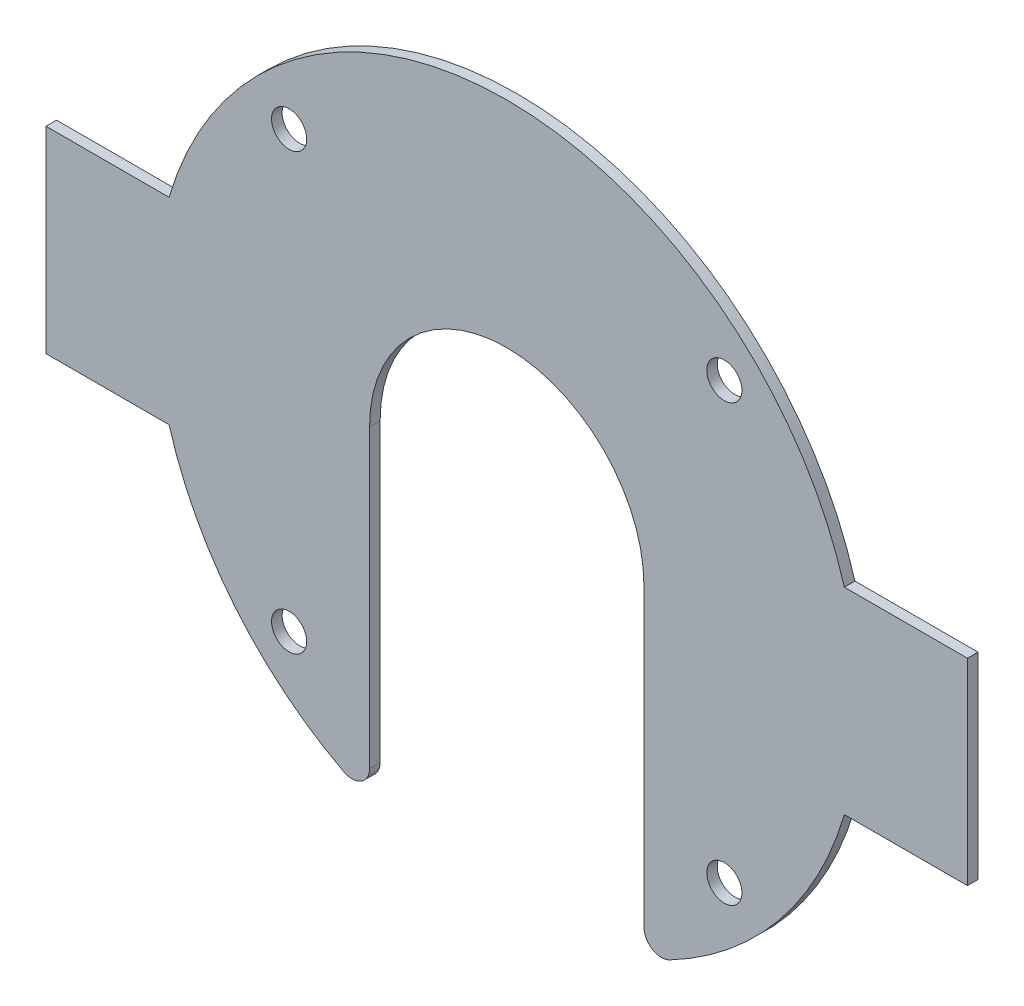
ISO-10303-21;
HEADER;
FILE_DESCRIPTION(('STEP AP214'),'2;1');
FILE_NAME('part.step','',(''),(''),'','','');
FILE_SCHEMA(('AUTOMOTIVE_DESIGN { 1 0 10303 214 1 1 1 1 }'));
ENDSEC;
DATA;
#1=APPLICATION_CONTEXT('core data for automotive mechanical design processes');
#2=APPLICATION_PROTOCOL_DEFINITION('international standard','automotive_design',2000,#1);
#3=PRODUCT_CONTEXT('',#1,'mechanical');
#4=PRODUCT('Part','Part','',(#3));
#5=PRODUCT_RELATED_PRODUCT_CATEGORY('part','',(#4));
#6=PRODUCT_DEFINITION_FORMATION('','',#4);
#7=PRODUCT_DEFINITION_CONTEXT('part definition',#1,'design');
#8=PRODUCT_DEFINITION('design','',#6,#7);
#9=PRODUCT_DEFINITION_SHAPE('','',#8);
#10=(LENGTH_UNIT() NAMED_UNIT(*) SI_UNIT(.MILLI.,.METRE.));
#11=(NAMED_UNIT(*) PLANE_ANGLE_UNIT() SI_UNIT($,.RADIAN.));
#12=(NAMED_UNIT(*) SI_UNIT($,.STERADIAN.) SOLID_ANGLE_UNIT());
#13=UNCERTAINTY_MEASURE_WITH_UNIT(LENGTH_MEASURE(1.E-05),#10,'distance_accuracy_value','');
#14=(GEOMETRIC_REPRESENTATION_CONTEXT(3) GLOBAL_UNCERTAINTY_ASSIGNED_CONTEXT((#13)) GLOBAL_UNIT_ASSIGNED_CONTEXT((#10,
#11,#12)) REPRESENTATION_CONTEXT('',''));
#15=CARTESIAN_POINT('',(0.,0.,0.));
#16=DIRECTION('',(0.,0.,1.));
#17=DIRECTION('',(1.,0.,0.));
#18=AXIS2_PLACEMENT_3D('',#15,#16,#17);
#19=CARTESIAN_POINT('',(0.,0.,3.));
#20=DIRECTION('',(0.,0.,1.));
#21=DIRECTION('',(1.,0.,0.));
#22=AXIS2_PLACEMENT_3D('',#19,#20,#21);
#23=PLANE('',#22);
#24=CARTESIAN_POINT('',(-61.8718433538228,-61.871843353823,3.));
#25=DIRECTION('',(0.,0.,1.));
#26=DIRECTION('',(1.,0.,0.));
#27=AXIS2_PLACEMENT_3D('',#24,#25,#26);
#28=CIRCLE('',#27,5.);
#29=CARTESIAN_POINT('',(-56.8718433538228,-61.871843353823,3.));
#30=VERTEX_POINT('',#29);
#31=EDGE_CURVE('E320',#30,#30,#28,.T.);
#32=ORIENTED_EDGE('',*,*,#31,.F.);
#33=EDGE_LOOP('',(#32));
#34=FACE_BOUND('',#33,.T.);
#35=CARTESIAN_POINT('',(61.8718433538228,61.871843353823,3.));
#36=DIRECTION('',(0.,0.,1.));
#37=DIRECTION('',(1.,0.,0.));
#38=AXIS2_PLACEMENT_3D('',#35,#36,#37);
#39=CIRCLE('',#38,5.);
#40=CARTESIAN_POINT('',(66.8718433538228,61.871843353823,3.));
#41=VERTEX_POINT('',#40);
#42=EDGE_CURVE('E172',#41,#41,#39,.T.);
#43=ORIENTED_EDGE('',*,*,#42,.F.);
#44=EDGE_LOOP('',(#43));
#45=FACE_BOUND('',#44,.T.);
#46=CARTESIAN_POINT('',(0.,0.,3.));
#47=DIRECTION('',(0.,0.,-1.));
#48=DIRECTION('',(1.,0.,0.));
#49=AXIS2_PLACEMENT_3D('',#46,#47,#48);
#50=CIRCLE('',#49,39.);
#51=CARTESIAN_POINT('',(-39.,0.,3.));
#52=VERTEX_POINT('',#51);
#53=CARTESIAN_POINT('',(39.,0.,3.));
#54=VERTEX_POINT('',#53);
#55=EDGE_CURVE('E195',#52,#54,#50,.T.);
#56=ORIENTED_EDGE('',*,*,#55,.T.);
#57=DIRECTION('',(0.,-1.,0.));
#58=VECTOR('',#57,1.);
#59=CARTESIAN_POINT('',(39.,0.,3.));
#60=LINE('',#59,#58);
#61=CARTESIAN_POINT('',(39.,-84.1961994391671,3.));
#62=VERTEX_POINT('',#61);
#63=EDGE_CURVE('E113',#54,#62,#60,.T.);
#64=ORIENTED_EDGE('',*,*,#63,.T.);
#65=CARTESIAN_POINT('',(44.,-84.1961994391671,3.));
#66=DIRECTION('',(0.,0.,1.));
#67=DIRECTION('',(-1.,0.,0.));
#68=AXIS2_PLACEMENT_3D('',#65,#66,#67);
#69=CIRCLE('',#68,5.);
#70=CARTESIAN_POINT('',(46.3157894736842,-88.627578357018,3.));
#71=VERTEX_POINT('',#70);
#72=EDGE_CURVE('E228',#62,#71,#69,.T.);
#73=ORIENTED_EDGE('',*,*,#72,.T.);
#74=CARTESIAN_POINT('',(0.,0.,3.));
#75=DIRECTION('',(0.,0.,1.));
#76=DIRECTION('',(1.,0.,0.));
#77=AXIS2_PLACEMENT_3D('',#74,#75,#76);
#78=CIRCLE('',#77,100.);
#79=CARTESIAN_POINT('',(96.,-28.,3.));
#80=VERTEX_POINT('',#79);
#81=EDGE_CURVE('E247',#71,#80,#78,.T.);
#82=ORIENTED_EDGE('',*,*,#81,.T.);
#83=DIRECTION('',(1.,0.,0.));
#84=VECTOR('',#83,1.);
#85=CARTESIAN_POINT('',(131.,-28.,3.));
#86=LINE('',#85,#84);
#87=CARTESIAN_POINT('',(131.,-28.,3.));
#88=VERTEX_POINT('',#87);
#89=EDGE_CURVE('E244',#80,#88,#86,.T.);
#90=ORIENTED_EDGE('',*,*,#89,.T.);
#91=DIRECTION('',(0.,1.,0.));
#92=VECTOR('',#91,1.);
#93=CARTESIAN_POINT('',(131.,28.,3.));
#94=LINE('',#93,#92);
#95=CARTESIAN_POINT('',(131.,28.,3.));
#96=VERTEX_POINT('',#95);
#97=EDGE_CURVE('E246',#88,#96,#94,.T.);
#98=ORIENTED_EDGE('',*,*,#97,.T.);
#99=DIRECTION('',(-1.,0.,0.));
#100=VECTOR('',#99,1.);
#101=CARTESIAN_POINT('',(96.,28.,3.));
#102=LINE('',#101,#100);
#103=CARTESIAN_POINT('',(96.,28.,3.));
#104=VERTEX_POINT('',#103);
#105=EDGE_CURVE('E249',#96,#104,#102,.T.);
#106=ORIENTED_EDGE('',*,*,#105,.T.);
#107=CARTESIAN_POINT('',(0.,0.,3.));
#108=DIRECTION('',(0.,0.,1.));
#109=DIRECTION('',(1.,0.,0.));
#110=AXIS2_PLACEMENT_3D('',#107,#108,#109);
#111=CIRCLE('',#110,100.);
#112=CARTESIAN_POINT('',(-96.,28.,3.));
#113=VERTEX_POINT('',#112);
#114=EDGE_CURVE('E255',#104,#113,#111,.T.);
#115=ORIENTED_EDGE('',*,*,#114,.T.);
#116=DIRECTION('',(-1.,0.,0.));
#117=VECTOR('',#116,1.);
#118=CARTESIAN_POINT('',(-96.,28.,3.));
#119=LINE('',#118,#117);
#120=CARTESIAN_POINT('',(-131.,28.,3.));
#121=VERTEX_POINT('',#120);
#122=EDGE_CURVE('E257',#113,#121,#119,.T.);
#123=ORIENTED_EDGE('',*,*,#122,.T.);
#124=DIRECTION('',(0.,-1.,0.));
#125=VECTOR('',#124,1.);
#126=CARTESIAN_POINT('',(-131.,28.,3.));
#127=LINE('',#126,#125);
#128=CARTESIAN_POINT('',(-131.,-28.,3.));
#129=VERTEX_POINT('',#128);
#130=EDGE_CURVE('E259',#121,#129,#127,.T.);
#131=ORIENTED_EDGE('',*,*,#130,.T.);
#132=DIRECTION('',(1.,0.,0.));
#133=VECTOR('',#132,1.);
#134=CARTESIAN_POINT('',(-131.,-28.,3.));
#135=LINE('',#134,#133);
#136=CARTESIAN_POINT('',(-96.,-28.,3.));
#137=VERTEX_POINT('',#136);
#138=EDGE_CURVE('E150',#129,#137,#135,.T.);
#139=ORIENTED_EDGE('',*,*,#138,.T.);
#140=CARTESIAN_POINT('',(0.,0.,3.));
#141=DIRECTION('',(0.,0.,1.));
#142=DIRECTION('',(1.,0.,0.));
#143=AXIS2_PLACEMENT_3D('',#140,#141,#142);
#144=CIRCLE('',#143,100.);
#145=CARTESIAN_POINT('',(-46.3157894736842,-88.627578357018,3.));
#146=VERTEX_POINT('',#145);
#147=EDGE_CURVE('E144',#137,#146,#144,.T.);
#148=ORIENTED_EDGE('',*,*,#147,.T.);
#149=CARTESIAN_POINT('',(-44.,-84.1961994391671,3.));
#150=DIRECTION('',(0.,0.,1.));
#151=DIRECTION('',(-1.,0.,0.));
#152=AXIS2_PLACEMENT_3D('',#149,#150,#151);
#153=CIRCLE('',#152,5.);
#154=CARTESIAN_POINT('',(-39.,-84.1961994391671,3.));
#155=VERTEX_POINT('',#154);
#156=EDGE_CURVE('E148',#146,#155,#153,.T.);
#157=ORIENTED_EDGE('',*,*,#156,.T.);
#158=DIRECTION('',(0.,1.,0.));
#159=VECTOR('',#158,1.);
#160=CARTESIAN_POINT('',(-39.,0.,3.));
#161=LINE('',#160,#159);
#162=EDGE_CURVE('E52',#155,#52,#161,.T.);
#163=ORIENTED_EDGE('',*,*,#162,.T.);
#164=EDGE_LOOP('',(#56,#64,#73,#82,#90,#98,#106,#115,#123,#131,#139,#148,#157,#163));
#165=FACE_BOUND('',#164,.T.);
#166=CARTESIAN_POINT('',(-61.8718433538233,61.8718433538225,3.));
#167=DIRECTION('',(0.,0.,1.));
#168=DIRECTION('',(1.,0.,0.));
#169=AXIS2_PLACEMENT_3D('',#166,#167,#168);
#170=CIRCLE('',#169,5.);
#171=CARTESIAN_POINT('',(-56.8718433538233,61.8718433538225,3.));
#172=VERTEX_POINT('',#171);
#173=EDGE_CURVE('E326',#172,#172,#170,.T.);
#174=ORIENTED_EDGE('',*,*,#173,.F.);
#175=EDGE_LOOP('',(#174));
#176=FACE_BOUND('',#175,.T.);
#177=CARTESIAN_POINT('',(61.8718433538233,-61.8718433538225,3.));
#178=DIRECTION('',(0.,0.,1.));
#179=DIRECTION('',(1.,0.,0.));
#180=AXIS2_PLACEMENT_3D('',#177,#178,#179);
#181=CIRCLE('',#180,5.);
#182=CARTESIAN_POINT('',(66.8718433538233,-61.8718433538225,3.));
#183=VERTEX_POINT('',#182);
#184=EDGE_CURVE('E311',#183,#183,#181,.T.);
#185=ORIENTED_EDGE('',*,*,#184,.F.);
#186=EDGE_LOOP('',(#185));
#187=FACE_BOUND('',#186,.T.);
#188=ADVANCED_FACE('F35',(#34,#45,#165,#176,#187),#23,.T.);
#189=CARTESIAN_POINT('',(0.,0.,0.));
#190=DIRECTION('',(0.,0.,1.));
#191=DIRECTION('',(1.,0.,0.));
#192=AXIS2_PLACEMENT_3D('',#189,#190,#191);
#193=PLANE('',#192);
#194=CARTESIAN_POINT('',(-61.8718433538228,-61.871843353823,0.));
#195=DIRECTION('',(0.,0.,1.));
#196=DIRECTION('',(1.,0.,0.));
#197=AXIS2_PLACEMENT_3D('',#194,#195,#196);
#198=CIRCLE('',#197,5.);
#199=CARTESIAN_POINT('',(-56.8718433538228,-61.871843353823,0.));
#200=VERTEX_POINT('',#199);
#201=EDGE_CURVE('E317',#200,#200,#198,.T.);
#202=ORIENTED_EDGE('',*,*,#201,.T.);
#203=EDGE_LOOP('',(#202));
#204=FACE_BOUND('',#203,.T.);
#205=CARTESIAN_POINT('',(61.8718433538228,61.871843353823,0.));
#206=DIRECTION('',(0.,0.,1.));
#207=DIRECTION('',(1.,0.,0.));
#208=AXIS2_PLACEMENT_3D('',#205,#206,#207);
#209=CIRCLE('',#208,5.);
#210=CARTESIAN_POINT('',(66.8718433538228,61.871843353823,0.));
#211=VERTEX_POINT('',#210);
#212=EDGE_CURVE('E329',#211,#211,#209,.T.);
#213=ORIENTED_EDGE('',*,*,#212,.T.);
#214=EDGE_LOOP('',(#213));
#215=FACE_BOUND('',#214,.T.);
#216=CARTESIAN_POINT('',(0.,0.,0.));
#217=DIRECTION('',(0.,0.,-1.));
#218=DIRECTION('',(1.,0.,0.));
#219=AXIS2_PLACEMENT_3D('',#216,#217,#218);
#220=CIRCLE('',#219,39.);
#221=CARTESIAN_POINT('',(-39.,0.,0.));
#222=VERTEX_POINT('',#221);
#223=CARTESIAN_POINT('',(39.,0.,0.));
#224=VERTEX_POINT('',#223);
#225=EDGE_CURVE('E168',#222,#224,#220,.T.);
#226=ORIENTED_EDGE('',*,*,#225,.F.);
#227=DIRECTION('',(0.,1.,0.));
#228=VECTOR('',#227,1.);
#229=CARTESIAN_POINT('',(-39.,0.,0.));
#230=LINE('',#229,#228);
#231=CARTESIAN_POINT('',(-39.,-84.1961994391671,0.));
#232=VERTEX_POINT('',#231);
#233=EDGE_CURVE('E105',#232,#222,#230,.T.);
#234=ORIENTED_EDGE('',*,*,#233,.F.);
#235=CARTESIAN_POINT('',(-44.,-84.1961994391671,0.));
#236=DIRECTION('',(0.,0.,1.));
#237=DIRECTION('',(-1.,0.,0.));
#238=AXIS2_PLACEMENT_3D('',#235,#236,#237);
#239=CIRCLE('',#238,5.);
#240=CARTESIAN_POINT('',(-46.3157894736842,-88.627578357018,0.));
#241=VERTEX_POINT('',#240);
#242=EDGE_CURVE('E99',#241,#232,#239,.T.);
#243=ORIENTED_EDGE('',*,*,#242,.F.);
#244=CARTESIAN_POINT('',(0.,0.,0.));
#245=DIRECTION('',(0.,0.,1.));
#246=DIRECTION('',(1.,0.,0.));
#247=AXIS2_PLACEMENT_3D('',#244,#245,#246);
#248=CIRCLE('',#247,100.);
#249=CARTESIAN_POINT('',(-96.,-28.,0.));
#250=VERTEX_POINT('',#249);
#251=EDGE_CURVE('E158',#250,#241,#248,.T.);
#252=ORIENTED_EDGE('',*,*,#251,.F.);
#253=DIRECTION('',(1.,0.,0.));
#254=VECTOR('',#253,1.);
#255=CARTESIAN_POINT('',(-131.,-28.,0.));
#256=LINE('',#255,#254);
#257=CARTESIAN_POINT('',(-131.,-28.,0.));
#258=VERTEX_POINT('',#257);
#259=EDGE_CURVE('E190',#258,#250,#256,.T.);
#260=ORIENTED_EDGE('',*,*,#259,.F.);
#261=DIRECTION('',(0.,-1.,0.));
#262=VECTOR('',#261,1.);
#263=CARTESIAN_POINT('',(-131.,28.,0.));
#264=LINE('',#263,#262);
#265=CARTESIAN_POINT('',(-131.,28.,0.));
#266=VERTEX_POINT('',#265);
#267=EDGE_CURVE('E188',#266,#258,#264,.T.);
#268=ORIENTED_EDGE('',*,*,#267,.F.);
#269=DIRECTION('',(-1.,0.,0.));
#270=VECTOR('',#269,1.);
#271=CARTESIAN_POINT('',(-96.,28.,0.));
#272=LINE('',#271,#270);
#273=CARTESIAN_POINT('',(-96.,28.,0.));
#274=VERTEX_POINT('',#273);
#275=EDGE_CURVE('E186',#274,#266,#272,.T.);
#276=ORIENTED_EDGE('',*,*,#275,.F.);
#277=CARTESIAN_POINT('',(0.,0.,0.));
#278=DIRECTION('',(0.,0.,1.));
#279=DIRECTION('',(1.,0.,0.));
#280=AXIS2_PLACEMENT_3D('',#277,#278,#279);
#281=CIRCLE('',#280,100.);
#282=CARTESIAN_POINT('',(96.,28.,0.));
#283=VERTEX_POINT('',#282);
#284=EDGE_CURVE('E184',#283,#274,#281,.T.);
#285=ORIENTED_EDGE('',*,*,#284,.F.);
#286=DIRECTION('',(-1.,0.,0.));
#287=VECTOR('',#286,1.);
#288=CARTESIAN_POINT('',(96.,28.,0.));
#289=LINE('',#288,#287);
#290=CARTESIAN_POINT('',(131.,28.,0.));
#291=VERTEX_POINT('',#290);
#292=EDGE_CURVE('E182',#291,#283,#289,.T.);
#293=ORIENTED_EDGE('',*,*,#292,.F.);
#294=DIRECTION('',(0.,1.,0.));
#295=VECTOR('',#294,1.);
#296=CARTESIAN_POINT('',(131.,28.,0.));
#297=LINE('',#296,#295);
#298=CARTESIAN_POINT('',(131.,-28.,0.));
#299=VERTEX_POINT('',#298);
#300=EDGE_CURVE('E180',#299,#291,#297,.T.);
#301=ORIENTED_EDGE('',*,*,#300,.F.);
#302=DIRECTION('',(1.,0.,0.));
#303=VECTOR('',#302,1.);
#304=CARTESIAN_POINT('',(131.,-28.,0.));
#305=LINE('',#304,#303);
#306=CARTESIAN_POINT('',(96.,-28.,0.));
#307=VERTEX_POINT('',#306);
#308=EDGE_CURVE('E178',#307,#299,#305,.T.);
#309=ORIENTED_EDGE('',*,*,#308,.F.);
#310=CARTESIAN_POINT('',(0.,0.,0.));
#311=DIRECTION('',(0.,0.,1.));
#312=DIRECTION('',(1.,0.,0.));
#313=AXIS2_PLACEMENT_3D('',#310,#311,#312);
#314=CIRCLE('',#313,100.);
#315=CARTESIAN_POINT('',(46.3157894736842,-88.627578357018,0.));
#316=VERTEX_POINT('',#315);
#317=EDGE_CURVE('E176',#316,#307,#314,.T.);
#318=ORIENTED_EDGE('',*,*,#317,.F.);
#319=CARTESIAN_POINT('',(44.,-84.1961994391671,0.));
#320=DIRECTION('',(0.,0.,1.));
#321=DIRECTION('',(-1.,0.,0.));
#322=AXIS2_PLACEMENT_3D('',#319,#320,#321);
#323=CIRCLE('',#322,5.);
#324=CARTESIAN_POINT('',(39.,-84.1961994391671,0.));
#325=VERTEX_POINT('',#324);
#326=EDGE_CURVE('E174',#325,#316,#323,.T.);
#327=ORIENTED_EDGE('',*,*,#326,.F.);
#328=DIRECTION('',(0.,-1.,0.));
#329=VECTOR('',#328,1.);
#330=CARTESIAN_POINT('',(39.,0.,0.));
#331=LINE('',#330,#329);
#332=EDGE_CURVE('E171',#224,#325,#331,.T.);
#333=ORIENTED_EDGE('',*,*,#332,.F.);
#334=EDGE_LOOP('',(#226,#234,#243,#252,#260,#268,#276,#285,#293,#301,#309,#318,#327,#333));
#335=FACE_BOUND('',#334,.T.);
#336=CARTESIAN_POINT('',(-61.8718433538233,61.8718433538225,0.));
#337=DIRECTION('',(0.,0.,1.));
#338=DIRECTION('',(1.,0.,0.));
#339=AXIS2_PLACEMENT_3D('',#336,#337,#338);
#340=CIRCLE('',#339,5.);
#341=CARTESIAN_POINT('',(-56.8718433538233,61.8718433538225,0.));
#342=VERTEX_POINT('',#341);
#343=EDGE_CURVE('E323',#342,#342,#340,.T.);
#344=ORIENTED_EDGE('',*,*,#343,.T.);
#345=EDGE_LOOP('',(#344));
#346=FACE_BOUND('',#345,.T.);
#347=CARTESIAN_POINT('',(61.8718433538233,-61.8718433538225,0.));
#348=DIRECTION('',(0.,0.,1.));
#349=DIRECTION('',(1.,0.,0.));
#350=AXIS2_PLACEMENT_3D('',#347,#348,#349);
#351=CIRCLE('',#350,5.);
#352=CARTESIAN_POINT('',(66.8718433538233,-61.8718433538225,0.));
#353=VERTEX_POINT('',#352);
#354=EDGE_CURVE('E314',#353,#353,#351,.T.);
#355=ORIENTED_EDGE('',*,*,#354,.T.);
#356=EDGE_LOOP('',(#355));
#357=FACE_BOUND('',#356,.T.);
#358=ADVANCED_FACE('F232',(#204,#215,#335,#346,#357),#193,.F.);
#359=CARTESIAN_POINT('',(0.,0.,3.));
#360=DIRECTION('',(0.,0.,-1.));
#361=DIRECTION('',(-1.,0.,0.));
#362=AXIS2_PLACEMENT_3D('',#359,#360,#361);
#363=CYLINDRICAL_SURFACE('',#362,39.);
#364=ORIENTED_EDGE('',*,*,#225,.T.);
#365=DIRECTION('',(0.,0.,-1.));
#366=VECTOR('',#365,1.);
#367=CARTESIAN_POINT('',(39.,0.,3.));
#368=LINE('',#367,#366);
#369=EDGE_CURVE('E11',#54,#224,#368,.T.);
#370=ORIENTED_EDGE('',*,*,#369,.F.);
#371=ORIENTED_EDGE('',*,*,#55,.F.);
#372=DIRECTION('',(0.,0.,-1.));
#373=VECTOR('',#372,1.);
#374=CARTESIAN_POINT('',(-39.,0.,3.));
#375=LINE('',#374,#373);
#376=EDGE_CURVE('E164',#52,#222,#375,.T.);
#377=ORIENTED_EDGE('',*,*,#376,.T.);
#378=EDGE_LOOP('',(#364,#370,#371,#377));
#379=FACE_BOUND('',#378,.T.);
#380=ADVANCED_FACE('F37',(#379),#363,.F.);
#381=CARTESIAN_POINT('',(39.,0.,3.));
#382=DIRECTION('',(1.,0.,0.));
#383=DIRECTION('',(0.,0.,-1.));
#384=AXIS2_PLACEMENT_3D('',#381,#382,#383);
#385=PLANE('',#384);
#386=ORIENTED_EDGE('',*,*,#332,.T.);
#387=DIRECTION('',(0.,0.,-1.));
#388=VECTOR('',#387,1.);
#389=CARTESIAN_POINT('',(39.,-84.1961994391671,3.));
#390=LINE('',#389,#388);
#391=EDGE_CURVE('E44',#62,#325,#390,.T.);
#392=ORIENTED_EDGE('',*,*,#391,.F.);
#393=ORIENTED_EDGE('',*,*,#63,.F.);
#394=ORIENTED_EDGE('',*,*,#369,.T.);
#395=EDGE_LOOP('',(#386,#392,#393,#394));
#396=FACE_BOUND('',#395,.T.);
#397=ADVANCED_FACE('F458',(#396),#385,.F.);
#398=CARTESIAN_POINT('',(44.,-84.1961994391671,3.));
#399=DIRECTION('',(0.,0.,-1.));
#400=DIRECTION('',(-1.,0.,0.));
#401=AXIS2_PLACEMENT_3D('',#398,#399,#400);
#402=CYLINDRICAL_SURFACE('',#401,5.);
#403=ORIENTED_EDGE('',*,*,#326,.T.);
#404=DIRECTION('',(0.,0.,-1.));
#405=VECTOR('',#404,1.);
#406=CARTESIAN_POINT('',(46.3157894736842,-88.627578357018,3.));
#407=LINE('',#406,#405);
#408=EDGE_CURVE('E220',#71,#316,#407,.T.);
#409=ORIENTED_EDGE('',*,*,#408,.F.);
#410=ORIENTED_EDGE('',*,*,#72,.F.);
#411=ORIENTED_EDGE('',*,*,#391,.T.);
#412=EDGE_LOOP('',(#403,#409,#410,#411));
#413=FACE_BOUND('',#412,.T.);
#414=ADVANCED_FACE('F226',(#413),#402,.T.);
#415=CARTESIAN_POINT('',(0.,0.,3.));
#416=DIRECTION('',(0.,0.,-1.));
#417=DIRECTION('',(-1.,0.,0.));
#418=AXIS2_PLACEMENT_3D('',#415,#416,#417);
#419=CYLINDRICAL_SURFACE('',#418,100.);
#420=ORIENTED_EDGE('',*,*,#317,.T.);
#421=DIRECTION('',(0.,0.,-1.));
#422=VECTOR('',#421,1.);
#423=CARTESIAN_POINT('',(96.,-28.,3.));
#424=LINE('',#423,#422);
#425=EDGE_CURVE('E217',#80,#307,#424,.T.);
#426=ORIENTED_EDGE('',*,*,#425,.F.);
#427=ORIENTED_EDGE('',*,*,#81,.F.);
#428=ORIENTED_EDGE('',*,*,#408,.T.);
#429=EDGE_LOOP('',(#420,#426,#427,#428));
#430=FACE_BOUND('',#429,.T.);
#431=ADVANCED_FACE('F238',(#430),#419,.T.);
#432=CARTESIAN_POINT('',(131.,-28.,3.));
#433=DIRECTION('',(0.,1.,0.));
#434=DIRECTION('',(-1.,0.,0.));
#435=AXIS2_PLACEMENT_3D('',#432,#433,#434);
#436=PLANE('',#435);
#437=ORIENTED_EDGE('',*,*,#308,.T.);
#438=DIRECTION('',(0.,0.,-1.));
#439=VECTOR('',#438,1.);
#440=CARTESIAN_POINT('',(131.,-28.,3.));
#441=LINE('',#440,#439);
#442=EDGE_CURVE('E214',#88,#299,#441,.T.);
#443=ORIENTED_EDGE('',*,*,#442,.F.);
#444=ORIENTED_EDGE('',*,*,#89,.F.);
#445=ORIENTED_EDGE('',*,*,#425,.T.);
#446=EDGE_LOOP('',(#437,#443,#444,#445));
#447=FACE_BOUND('',#446,.T.);
#448=ADVANCED_FACE('F242',(#447),#436,.F.);
#449=CARTESIAN_POINT('',(131.,28.,3.));
#450=DIRECTION('',(-1.,0.,0.));
#451=DIRECTION('',(0.,0.,1.));
#452=AXIS2_PLACEMENT_3D('',#449,#450,#451);
#453=PLANE('',#452);
#454=ORIENTED_EDGE('',*,*,#300,.T.);
#455=DIRECTION('',(0.,0.,-1.));
#456=VECTOR('',#455,1.);
#457=CARTESIAN_POINT('',(131.,28.,3.));
#458=LINE('',#457,#456);
#459=EDGE_CURVE('E211',#96,#291,#458,.T.);
#460=ORIENTED_EDGE('',*,*,#459,.F.);
#461=ORIENTED_EDGE('',*,*,#97,.F.);
#462=ORIENTED_EDGE('',*,*,#442,.T.);
#463=EDGE_LOOP('',(#454,#460,#461,#462));
#464=FACE_BOUND('',#463,.T.);
#465=ADVANCED_FACE('F423',(#464),#453,.F.);
#466=CARTESIAN_POINT('',(96.,28.,3.));
#467=DIRECTION('',(0.,-1.,0.));
#468=DIRECTION('',(1.,0.,0.));
#469=AXIS2_PLACEMENT_3D('',#466,#467,#468);
#470=PLANE('',#469);
#471=ORIENTED_EDGE('',*,*,#292,.T.);
#472=DIRECTION('',(0.,0.,-1.));
#473=VECTOR('',#472,1.);
#474=CARTESIAN_POINT('',(96.,28.,3.));
#475=LINE('',#474,#473);
#476=EDGE_CURVE('E208',#104,#283,#475,.T.);
#477=ORIENTED_EDGE('',*,*,#476,.F.);
#478=ORIENTED_EDGE('',*,*,#105,.F.);
#479=ORIENTED_EDGE('',*,*,#459,.T.);
#480=EDGE_LOOP('',(#471,#477,#478,#479));
#481=FACE_BOUND('',#480,.T.);
#482=ADVANCED_FACE('F413',(#481),#470,.F.);
#483=CARTESIAN_POINT('',(0.,0.,3.));
#484=DIRECTION('',(0.,0.,-1.));
#485=DIRECTION('',(-1.,0.,0.));
#486=AXIS2_PLACEMENT_3D('',#483,#484,#485);
#487=CYLINDRICAL_SURFACE('',#486,100.);
#488=ORIENTED_EDGE('',*,*,#284,.T.);
#489=DIRECTION('',(0.,0.,-1.));
#490=VECTOR('',#489,1.);
#491=CARTESIAN_POINT('',(-96.,28.,3.));
#492=LINE('',#491,#490);
#493=EDGE_CURVE('E205',#113,#274,#492,.T.);
#494=ORIENTED_EDGE('',*,*,#493,.F.);
#495=ORIENTED_EDGE('',*,*,#114,.F.);
#496=ORIENTED_EDGE('',*,*,#476,.T.);
#497=EDGE_LOOP('',(#488,#494,#495,#496));
#498=FACE_BOUND('',#497,.T.);
#499=ADVANCED_FACE('F403',(#498),#487,.T.);
#500=CARTESIAN_POINT('',(-96.,28.,3.));
#501=DIRECTION('',(0.,-1.,0.));
#502=DIRECTION('',(0.,0.,-1.));
#503=AXIS2_PLACEMENT_3D('',#500,#501,#502);
#504=PLANE('',#503);
#505=ORIENTED_EDGE('',*,*,#275,.T.);
#506=DIRECTION('',(0.,0.,-1.));
#507=VECTOR('',#506,1.);
#508=CARTESIAN_POINT('',(-131.,28.,3.));
#509=LINE('',#508,#507);
#510=EDGE_CURVE('E202',#121,#266,#509,.T.);
#511=ORIENTED_EDGE('',*,*,#510,.F.);
#512=ORIENTED_EDGE('',*,*,#122,.F.);
#513=ORIENTED_EDGE('',*,*,#493,.T.);
#514=EDGE_LOOP('',(#505,#511,#512,#513));
#515=FACE_BOUND('',#514,.T.);
#516=ADVANCED_FACE('F394',(#515),#504,.F.);
#517=CARTESIAN_POINT('',(-131.,28.,3.));
#518=DIRECTION('',(1.,0.,0.));
#519=DIRECTION('',(0.,1.,0.));
#520=AXIS2_PLACEMENT_3D('',#517,#518,#519);
#521=PLANE('',#520);
#522=ORIENTED_EDGE('',*,*,#267,.T.);
#523=DIRECTION('',(0.,0.,-1.));
#524=VECTOR('',#523,1.);
#525=CARTESIAN_POINT('',(-131.,-28.,3.));
#526=LINE('',#525,#524);
#527=EDGE_CURVE('E199',#129,#258,#526,.T.);
#528=ORIENTED_EDGE('',*,*,#527,.F.);
#529=ORIENTED_EDGE('',*,*,#130,.F.);
#530=ORIENTED_EDGE('',*,*,#510,.T.);
#531=EDGE_LOOP('',(#522,#528,#529,#530));
#532=FACE_BOUND('',#531,.T.);
#533=ADVANCED_FACE('F265',(#532),#521,.F.);
#534=CARTESIAN_POINT('',(-131.,-28.,3.));
#535=DIRECTION('',(0.,1.,0.));
#536=DIRECTION('',(0.,0.,1.));
#537=AXIS2_PLACEMENT_3D('',#534,#535,#536);
#538=PLANE('',#537);
#539=ORIENTED_EDGE('',*,*,#259,.T.);
#540=DIRECTION('',(0.,0.,-1.));
#541=VECTOR('',#540,1.);
#542=CARTESIAN_POINT('',(-96.,-28.,3.));
#543=LINE('',#542,#541);
#544=EDGE_CURVE('E159',#137,#250,#543,.T.);
#545=ORIENTED_EDGE('',*,*,#544,.F.);
#546=ORIENTED_EDGE('',*,*,#138,.F.);
#547=ORIENTED_EDGE('',*,*,#527,.T.);
#548=EDGE_LOOP('',(#539,#545,#546,#547));
#549=FACE_BOUND('',#548,.T.);
#550=ADVANCED_FACE('F269',(#549),#538,.F.);
#551=CARTESIAN_POINT('',(0.,0.,3.));
#552=DIRECTION('',(0.,0.,-1.));
#553=DIRECTION('',(-1.,0.,0.));
#554=AXIS2_PLACEMENT_3D('',#551,#552,#553);
#555=CYLINDRICAL_SURFACE('',#554,100.);
#556=ORIENTED_EDGE('',*,*,#251,.T.);
#557=DIRECTION('',(0.,0.,-1.));
#558=VECTOR('',#557,1.);
#559=CARTESIAN_POINT('',(-46.3157894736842,-88.627578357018,3.));
#560=LINE('',#559,#558);
#561=EDGE_CURVE('E155',#146,#241,#560,.T.);
#562=ORIENTED_EDGE('',*,*,#561,.F.);
#563=ORIENTED_EDGE('',*,*,#147,.F.);
#564=ORIENTED_EDGE('',*,*,#544,.T.);
#565=EDGE_LOOP('',(#556,#562,#563,#564));
#566=FACE_BOUND('',#565,.T.);
#567=ADVANCED_FACE('F156',(#566),#555,.T.);
#568=CARTESIAN_POINT('',(-44.,-84.1961994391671,3.));
#569=DIRECTION('',(0.,0.,-1.));
#570=DIRECTION('',(-1.,0.,0.));
#571=AXIS2_PLACEMENT_3D('',#568,#569,#570);
#572=CYLINDRICAL_SURFACE('',#571,5.);
#573=ORIENTED_EDGE('',*,*,#242,.T.);
#574=DIRECTION('',(0.,0.,-1.));
#575=VECTOR('',#574,1.);
#576=CARTESIAN_POINT('',(-39.,-84.1961994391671,3.));
#577=LINE('',#576,#575);
#578=EDGE_CURVE('E160',#155,#232,#577,.T.);
#579=ORIENTED_EDGE('',*,*,#578,.F.);
#580=ORIENTED_EDGE('',*,*,#156,.F.);
#581=ORIENTED_EDGE('',*,*,#561,.T.);
#582=EDGE_LOOP('',(#573,#579,#580,#581));
#583=FACE_BOUND('',#582,.T.);
#584=ADVANCED_FACE('F162',(#583),#572,.T.);
#585=CARTESIAN_POINT('',(-39.,0.,3.));
#586=DIRECTION('',(-1.,0.,0.));
#587=DIRECTION('',(0.,0.,1.));
#588=AXIS2_PLACEMENT_3D('',#585,#586,#587);
#589=PLANE('',#588);
#590=ORIENTED_EDGE('',*,*,#233,.T.);
#591=ORIENTED_EDGE('',*,*,#376,.F.);
#592=ORIENTED_EDGE('',*,*,#162,.F.);
#593=ORIENTED_EDGE('',*,*,#578,.T.);
#594=EDGE_LOOP('',(#590,#591,#592,#593));
#595=FACE_BOUND('',#594,.T.);
#596=ADVANCED_FACE('F273',(#595),#589,.F.);
#597=CARTESIAN_POINT('',(61.8718433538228,61.871843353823,3.));
#598=DIRECTION('',(0.,0.,-1.));
#599=DIRECTION('',(-1.,0.,0.));
#600=AXIS2_PLACEMENT_3D('',#597,#598,#599);
#601=CYLINDRICAL_SURFACE('',#600,5.);
#602=ORIENTED_EDGE('',*,*,#42,.T.);
#603=EDGE_LOOP('',(#602));
#604=FACE_BOUND('',#603,.T.);
#605=ORIENTED_EDGE('',*,*,#212,.F.);
#606=EDGE_LOOP('',(#605));
#607=FACE_BOUND('',#606,.T.);
#608=ADVANCED_FACE('F275',(#604,#607),#601,.F.);
#609=CARTESIAN_POINT('',(-61.8718433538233,61.8718433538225,3.));
#610=DIRECTION('',(0.,0.,-1.));
#611=DIRECTION('',(-1.,0.,0.));
#612=AXIS2_PLACEMENT_3D('',#609,#610,#611);
#613=CYLINDRICAL_SURFACE('',#612,5.);
#614=ORIENTED_EDGE('',*,*,#173,.T.);
#615=EDGE_LOOP('',(#614));
#616=FACE_BOUND('',#615,.T.);
#617=ORIENTED_EDGE('',*,*,#343,.F.);
#618=EDGE_LOOP('',(#617));
#619=FACE_BOUND('',#618,.T.);
#620=ADVANCED_FACE('F281',(#616,#619),#613,.F.);
#621=CARTESIAN_POINT('',(-61.8718433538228,-61.871843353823,3.));
#622=DIRECTION('',(0.,0.,-1.));
#623=DIRECTION('',(-1.,0.,0.));
#624=AXIS2_PLACEMENT_3D('',#621,#622,#623);
#625=CYLINDRICAL_SURFACE('',#624,5.);
#626=ORIENTED_EDGE('',*,*,#31,.T.);
#627=EDGE_LOOP('',(#626));
#628=FACE_BOUND('',#627,.T.);
#629=ORIENTED_EDGE('',*,*,#201,.F.);
#630=EDGE_LOOP('',(#629));
#631=FACE_BOUND('',#630,.T.);
#632=ADVANCED_FACE('F298',(#628,#631),#625,.F.);
#633=CARTESIAN_POINT('',(61.8718433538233,-61.8718433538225,3.));
#634=DIRECTION('',(0.,0.,-1.));
#635=DIRECTION('',(-1.,0.,0.));
#636=AXIS2_PLACEMENT_3D('',#633,#634,#635);
#637=CYLINDRICAL_SURFACE('',#636,5.);
#638=ORIENTED_EDGE('',*,*,#184,.T.);
#639=EDGE_LOOP('',(#638));
#640=FACE_BOUND('',#639,.T.);
#641=ORIENTED_EDGE('',*,*,#354,.F.);
#642=EDGE_LOOP('',(#641));
#643=FACE_BOUND('',#642,.T.);
#644=ADVANCED_FACE('F302',(#640,#643),#637,.F.);
#645=CLOSED_SHELL('',(#188,#358,#380,#397,#414,#431,#448,#465,#482,#499,#516,#533,#550,#567,
#584,#596,#608,#620,#632,#644));
#646=MANIFOLD_SOLID_BREP('B2',#645);
#647=ADVANCED_BREP_SHAPE_REPRESENTATION('',(#18,#646),#14);
#648=SHAPE_DEFINITION_REPRESENTATION(#9,#647);
ENDSEC;
END-ISO-10303-21;
